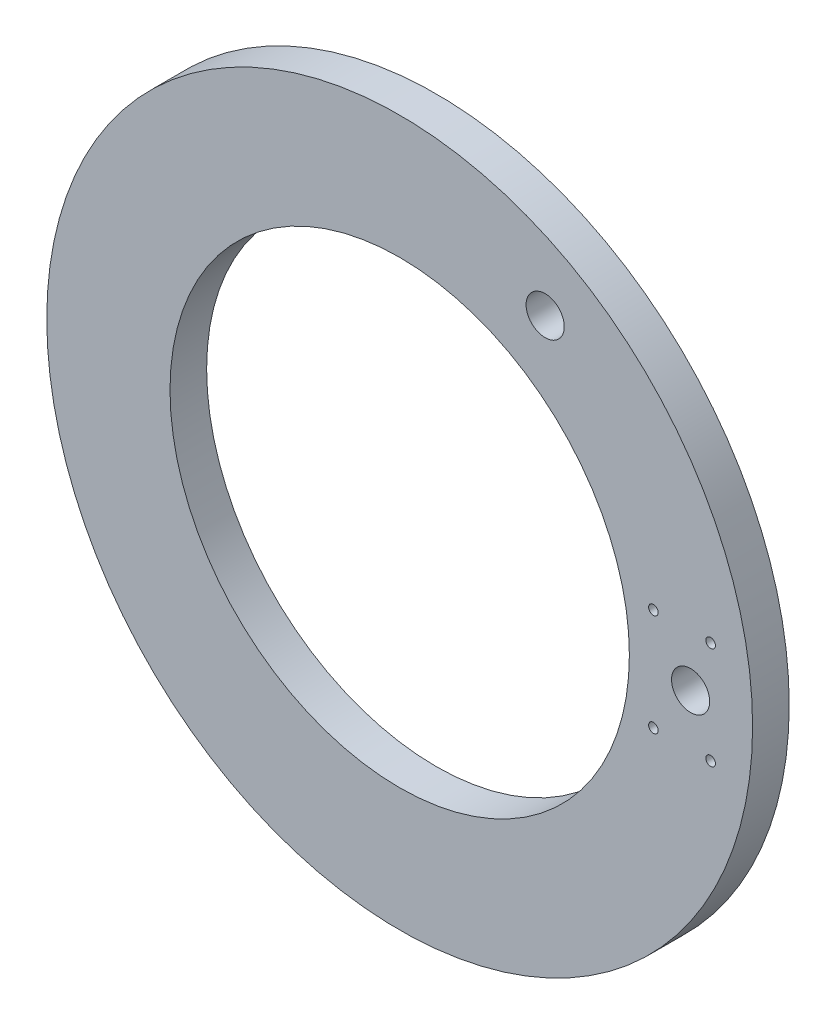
ISO-10303-21;
HEADER;
FILE_DESCRIPTION(('STEP AP214'),'2;1');
FILE_NAME('part.step','',(''),(''),'','','');
FILE_SCHEMA(('AUTOMOTIVE_DESIGN { 1 0 10303 214 1 1 1 1 }'));
ENDSEC;
DATA;
#1=APPLICATION_CONTEXT('core data for automotive mechanical design processes');
#2=APPLICATION_PROTOCOL_DEFINITION('international standard','automotive_design',2000,#1);
#3=PRODUCT_CONTEXT('',#1,'mechanical');
#4=PRODUCT('Part','Part','',(#3));
#5=PRODUCT_RELATED_PRODUCT_CATEGORY('part','',(#4));
#6=PRODUCT_DEFINITION_FORMATION('','',#4);
#7=PRODUCT_DEFINITION_CONTEXT('part definition',#1,'design');
#8=PRODUCT_DEFINITION('design','',#6,#7);
#9=PRODUCT_DEFINITION_SHAPE('','',#8);
#10=(LENGTH_UNIT() NAMED_UNIT(*) SI_UNIT(.MILLI.,.METRE.));
#11=(NAMED_UNIT(*) PLANE_ANGLE_UNIT() SI_UNIT($,.RADIAN.));
#12=(NAMED_UNIT(*) SI_UNIT($,.STERADIAN.) SOLID_ANGLE_UNIT());
#13=UNCERTAINTY_MEASURE_WITH_UNIT(LENGTH_MEASURE(1.E-05),#10,'distance_accuracy_value','');
#14=(GEOMETRIC_REPRESENTATION_CONTEXT(3) GLOBAL_UNCERTAINTY_ASSIGNED_CONTEXT((#13)) GLOBAL_UNIT_ASSIGNED_CONTEXT((#10,
#11,#12)) REPRESENTATION_CONTEXT('',''));
#15=CARTESIAN_POINT('',(0.,0.,0.));
#16=DIRECTION('',(0.,0.,1.));
#17=DIRECTION('',(1.,0.,0.));
#18=AXIS2_PLACEMENT_3D('',#15,#16,#17);
#19=CARTESIAN_POINT('',(0.,0.,24.384));
#20=DIRECTION('',(0.,0.,1.));
#21=DIRECTION('',(1.,0.,0.));
#22=AXIS2_PLACEMENT_3D('',#19,#20,#21);
#23=PLANE('',#22);
#24=CARTESIAN_POINT('',(96.8502,167.7162,24.384));
#25=DIRECTION('',(0.,0.,1.));
#26=DIRECTION('',(1.,0.,0.));
#27=AXIS2_PLACEMENT_3D('',#24,#25,#26);
#28=CIRCLE('',#27,12.7);
#29=CARTESIAN_POINT('',(109.5502,167.7162,24.384));
#30=VERTEX_POINT('',#29);
#31=EDGE_CURVE('E86',#30,#30,#28,.T.);
#32=ORIENTED_EDGE('',*,*,#31,.F.);
#33=EDGE_LOOP('',(#32));
#34=FACE_BOUND('',#33,.T.);
#35=CARTESIAN_POINT('',(207.01,-33.89122,24.384));
#36=DIRECTION('',(0.,0.,1.));
#37=DIRECTION('',(1.,0.,0.));
#38=AXIS2_PLACEMENT_3D('',#35,#36,#37);
#39=CIRCLE('',#38,3.175);
#40=CARTESIAN_POINT('',(210.185,-33.89122,24.384));
#41=VERTEX_POINT('',#40);
#42=EDGE_CURVE('E80',#41,#41,#39,.T.);
#43=ORIENTED_EDGE('',*,*,#42,.F.);
#44=EDGE_LOOP('',(#43));
#45=FACE_BOUND('',#44,.T.);
#46=CARTESIAN_POINT('',(207.01,34.1249,24.384));
#47=DIRECTION('',(0.,0.,1.));
#48=DIRECTION('',(1.,0.,0.));
#49=AXIS2_PLACEMENT_3D('',#46,#47,#48);
#50=CIRCLE('',#49,3.175);
#51=CARTESIAN_POINT('',(210.185,34.1249,24.384));
#52=VERTEX_POINT('',#51);
#53=EDGE_CURVE('E74',#52,#52,#50,.T.);
#54=ORIENTED_EDGE('',*,*,#53,.F.);
#55=EDGE_LOOP('',(#54));
#56=FACE_BOUND('',#55,.T.);
#57=CARTESIAN_POINT('',(168.91,-33.89122,24.384));
#58=DIRECTION('',(0.,0.,1.));
#59=DIRECTION('',(1.,0.,0.));
#60=AXIS2_PLACEMENT_3D('',#57,#58,#59);
#61=CIRCLE('',#60,3.175);
#62=CARTESIAN_POINT('',(172.085,-33.89122,24.384));
#63=VERTEX_POINT('',#62);
#64=EDGE_CURVE('E68',#63,#63,#61,.T.);
#65=ORIENTED_EDGE('',*,*,#64,.F.);
#66=EDGE_LOOP('',(#65));
#67=FACE_BOUND('',#66,.T.);
#68=CARTESIAN_POINT('',(168.91,34.1249,24.384));
#69=DIRECTION('',(0.,0.,1.));
#70=DIRECTION('',(1.,0.,0.));
#71=AXIS2_PLACEMENT_3D('',#68,#69,#70);
#72=CIRCLE('',#71,3.175);
#73=CARTESIAN_POINT('',(172.085,34.1249,24.384));
#74=VERTEX_POINT('',#73);
#75=EDGE_CURVE('E62',#74,#74,#72,.T.);
#76=ORIENTED_EDGE('',*,*,#75,.F.);
#77=EDGE_LOOP('',(#76));
#78=FACE_BOUND('',#77,.T.);
#79=CARTESIAN_POINT('',(193.675,0.,24.384));
#80=DIRECTION('',(0.,0.,1.));
#81=DIRECTION('',(1.,0.,0.));
#82=AXIS2_PLACEMENT_3D('',#79,#80,#81);
#83=CIRCLE('',#82,12.7);
#84=CARTESIAN_POINT('',(206.375,0.,24.384));
#85=VERTEX_POINT('',#84);
#86=EDGE_CURVE('E56',#85,#85,#83,.T.);
#87=ORIENTED_EDGE('',*,*,#86,.F.);
#88=EDGE_LOOP('',(#87));
#89=FACE_BOUND('',#88,.T.);
#90=CARTESIAN_POINT('',(0.,0.,24.384));
#91=DIRECTION('',(0.,0.,1.));
#92=DIRECTION('',(1.,0.,0.));
#93=AXIS2_PLACEMENT_3D('',#90,#91,#92);
#94=CIRCLE('',#93,234.95);
#95=CARTESIAN_POINT('',(-234.95,0.,24.384));
#96=VERTEX_POINT('',#95);
#97=EDGE_CURVE('E10',#96,#96,#94,.T.);
#98=ORIENTED_EDGE('',*,*,#97,.T.);
#99=EDGE_LOOP('',(#98));
#100=FACE_BOUND('',#99,.T.);
#101=CARTESIAN_POINT('',(0.,0.,24.384));
#102=DIRECTION('',(0.,0.,1.));
#103=DIRECTION('',(1.,0.,0.));
#104=AXIS2_PLACEMENT_3D('',#101,#102,#103);
#105=CIRCLE('',#104,152.908);
#106=CARTESIAN_POINT('',(-152.908,0.,24.384));
#107=VERTEX_POINT('',#106);
#108=EDGE_CURVE('E44',#107,#107,#105,.T.);
#109=ORIENTED_EDGE('',*,*,#108,.F.);
#110=EDGE_LOOP('',(#109));
#111=FACE_BOUND('',#110,.T.);
#112=ADVANCED_FACE('F33',(#34,#45,#56,#67,#78,#89,#100,#111),#23,.T.);
#113=CARTESIAN_POINT('',(0.,0.,0.));
#114=DIRECTION('',(0.,0.,1.));
#115=DIRECTION('',(1.,0.,0.));
#116=AXIS2_PLACEMENT_3D('',#113,#114,#115);
#117=PLANE('',#116);
#118=CARTESIAN_POINT('',(96.8502,167.7162,0.));
#119=DIRECTION('',(0.,0.,1.));
#120=DIRECTION('',(1.,0.,0.));
#121=AXIS2_PLACEMENT_3D('',#118,#119,#120);
#122=CIRCLE('',#121,12.7);
#123=CARTESIAN_POINT('',(109.5502,167.7162,0.));
#124=VERTEX_POINT('',#123);
#125=EDGE_CURVE('E83',#124,#124,#122,.T.);
#126=ORIENTED_EDGE('',*,*,#125,.T.);
#127=EDGE_LOOP('',(#126));
#128=FACE_BOUND('',#127,.T.);
#129=CARTESIAN_POINT('',(207.01,-33.89122,0.));
#130=DIRECTION('',(0.,0.,1.));
#131=DIRECTION('',(1.,0.,0.));
#132=AXIS2_PLACEMENT_3D('',#129,#130,#131);
#133=CIRCLE('',#132,3.175);
#134=CARTESIAN_POINT('',(210.185,-33.89122,0.));
#135=VERTEX_POINT('',#134);
#136=EDGE_CURVE('E77',#135,#135,#133,.T.);
#137=ORIENTED_EDGE('',*,*,#136,.T.);
#138=EDGE_LOOP('',(#137));
#139=FACE_BOUND('',#138,.T.);
#140=CARTESIAN_POINT('',(207.01,34.1249,0.));
#141=DIRECTION('',(0.,0.,1.));
#142=DIRECTION('',(1.,0.,0.));
#143=AXIS2_PLACEMENT_3D('',#140,#141,#142);
#144=CIRCLE('',#143,3.175);
#145=CARTESIAN_POINT('',(210.185,34.1249,0.));
#146=VERTEX_POINT('',#145);
#147=EDGE_CURVE('E71',#146,#146,#144,.T.);
#148=ORIENTED_EDGE('',*,*,#147,.T.);
#149=EDGE_LOOP('',(#148));
#150=FACE_BOUND('',#149,.T.);
#151=CARTESIAN_POINT('',(168.91,-33.89122,0.));
#152=DIRECTION('',(0.,0.,1.));
#153=DIRECTION('',(1.,0.,0.));
#154=AXIS2_PLACEMENT_3D('',#151,#152,#153);
#155=CIRCLE('',#154,3.175);
#156=CARTESIAN_POINT('',(172.085,-33.89122,0.));
#157=VERTEX_POINT('',#156);
#158=EDGE_CURVE('E65',#157,#157,#155,.T.);
#159=ORIENTED_EDGE('',*,*,#158,.T.);
#160=EDGE_LOOP('',(#159));
#161=FACE_BOUND('',#160,.T.);
#162=CARTESIAN_POINT('',(168.91,34.1249,0.));
#163=DIRECTION('',(0.,0.,1.));
#164=DIRECTION('',(1.,0.,0.));
#165=AXIS2_PLACEMENT_3D('',#162,#163,#164);
#166=CIRCLE('',#165,3.175);
#167=CARTESIAN_POINT('',(172.085,34.1249,0.));
#168=VERTEX_POINT('',#167);
#169=EDGE_CURVE('E59',#168,#168,#166,.T.);
#170=ORIENTED_EDGE('',*,*,#169,.T.);
#171=EDGE_LOOP('',(#170));
#172=FACE_BOUND('',#171,.T.);
#173=CARTESIAN_POINT('',(193.675,0.,0.));
#174=DIRECTION('',(0.,0.,1.));
#175=DIRECTION('',(1.,0.,0.));
#176=AXIS2_PLACEMENT_3D('',#173,#174,#175);
#177=CIRCLE('',#176,12.7);
#178=CARTESIAN_POINT('',(206.375,0.,0.));
#179=VERTEX_POINT('',#178);
#180=EDGE_CURVE('E53',#179,#179,#177,.T.);
#181=ORIENTED_EDGE('',*,*,#180,.T.);
#182=EDGE_LOOP('',(#181));
#183=FACE_BOUND('',#182,.T.);
#184=CARTESIAN_POINT('',(0.,0.,0.));
#185=DIRECTION('',(0.,0.,1.));
#186=DIRECTION('',(1.,0.,0.));
#187=AXIS2_PLACEMENT_3D('',#184,#185,#186);
#188=CIRCLE('',#187,234.95);
#189=CARTESIAN_POINT('',(-234.95,0.,0.));
#190=VERTEX_POINT('',#189);
#191=EDGE_CURVE('E40',#190,#190,#188,.T.);
#192=ORIENTED_EDGE('',*,*,#191,.F.);
#193=EDGE_LOOP('',(#192));
#194=FACE_BOUND('',#193,.T.);
#195=CARTESIAN_POINT('',(0.,0.,0.));
#196=DIRECTION('',(0.,0.,1.));
#197=DIRECTION('',(1.,0.,0.));
#198=AXIS2_PLACEMENT_3D('',#195,#196,#197);
#199=CIRCLE('',#198,152.908);
#200=CARTESIAN_POINT('',(-152.908,0.,0.));
#201=VERTEX_POINT('',#200);
#202=EDGE_CURVE('E48',#201,#201,#199,.T.);
#203=ORIENTED_EDGE('',*,*,#202,.T.);
#204=EDGE_LOOP('',(#203));
#205=FACE_BOUND('',#204,.T.);
#206=ADVANCED_FACE('F94',(#128,#139,#150,#161,#172,#183,#194,#205),#117,.F.);
#207=CARTESIAN_POINT('',(0.,0.,24.384));
#208=DIRECTION('',(0.,0.,-1.));
#209=DIRECTION('',(-1.,0.,0.));
#210=AXIS2_PLACEMENT_3D('',#207,#208,#209);
#211=CYLINDRICAL_SURFACE('',#210,234.95);
#212=CARTESIAN_POINT('',(-234.95,0.,24.384));
#213=CARTESIAN_POINT('',(-234.95,0.,24.13));
#214=CARTESIAN_POINT('',(-234.95,0.,23.876));
#215=CARTESIAN_POINT('',(-234.95,0.,23.368));
#216=CARTESIAN_POINT('',(-234.95,0.,23.114));
#217=CARTESIAN_POINT('',(-234.95,0.,22.606));
#218=CARTESIAN_POINT('',(-234.95,0.,22.352));
#219=CARTESIAN_POINT('',(-234.95,0.,21.844));
#220=CARTESIAN_POINT('',(-234.95,0.,21.59));
#221=CARTESIAN_POINT('',(-234.95,0.,21.082));
#222=CARTESIAN_POINT('',(-234.95,0.,20.828));
#223=CARTESIAN_POINT('',(-234.95,0.,20.32));
#224=CARTESIAN_POINT('',(-234.95,0.,20.066));
#225=CARTESIAN_POINT('',(-234.95,0.,19.558));
#226=CARTESIAN_POINT('',(-234.95,0.,19.304));
#227=CARTESIAN_POINT('',(-234.95,0.,18.796));
#228=CARTESIAN_POINT('',(-234.95,0.,18.542));
#229=CARTESIAN_POINT('',(-234.95,0.,18.034));
#230=CARTESIAN_POINT('',(-234.95,0.,17.78));
#231=CARTESIAN_POINT('',(-234.95,0.,17.272));
#232=CARTESIAN_POINT('',(-234.95,0.,17.018));
#233=CARTESIAN_POINT('',(-234.95,0.,16.51));
#234=CARTESIAN_POINT('',(-234.95,0.,16.256));
#235=CARTESIAN_POINT('',(-234.95,0.,15.748));
#236=CARTESIAN_POINT('',(-234.95,0.,15.494));
#237=CARTESIAN_POINT('',(-234.95,0.,14.986));
#238=CARTESIAN_POINT('',(-234.95,0.,14.732));
#239=CARTESIAN_POINT('',(-234.95,0.,14.224));
#240=CARTESIAN_POINT('',(-234.95,0.,13.97));
#241=CARTESIAN_POINT('',(-234.95,0.,13.462));
#242=CARTESIAN_POINT('',(-234.95,0.,13.208));
#243=CARTESIAN_POINT('',(-234.95,0.,12.7));
#244=CARTESIAN_POINT('',(-234.95,0.,12.446));
#245=CARTESIAN_POINT('',(-234.95,0.,11.938));
#246=CARTESIAN_POINT('',(-234.95,0.,11.684));
#247=CARTESIAN_POINT('',(-234.95,0.,11.176));
#248=CARTESIAN_POINT('',(-234.95,0.,10.922));
#249=CARTESIAN_POINT('',(-234.95,0.,10.414));
#250=CARTESIAN_POINT('',(-234.95,0.,10.16));
#251=CARTESIAN_POINT('',(-234.95,0.,9.652));
#252=CARTESIAN_POINT('',(-234.95,0.,9.398));
#253=CARTESIAN_POINT('',(-234.95,0.,8.89));
#254=CARTESIAN_POINT('',(-234.95,0.,8.636));
#255=CARTESIAN_POINT('',(-234.95,0.,8.128));
#256=CARTESIAN_POINT('',(-234.95,0.,7.874));
#257=CARTESIAN_POINT('',(-234.95,0.,7.366));
#258=CARTESIAN_POINT('',(-234.95,0.,7.112));
#259=CARTESIAN_POINT('',(-234.95,0.,6.604));
#260=CARTESIAN_POINT('',(-234.95,0.,6.35));
#261=CARTESIAN_POINT('',(-234.95,0.,5.842));
#262=CARTESIAN_POINT('',(-234.95,0.,5.588));
#263=CARTESIAN_POINT('',(-234.95,0.,5.08));
#264=CARTESIAN_POINT('',(-234.95,0.,4.826));
#265=CARTESIAN_POINT('',(-234.95,0.,4.318));
#266=CARTESIAN_POINT('',(-234.95,0.,4.064));
#267=CARTESIAN_POINT('',(-234.95,0.,3.556));
#268=CARTESIAN_POINT('',(-234.95,0.,3.302));
#269=CARTESIAN_POINT('',(-234.95,0.,2.794));
#270=CARTESIAN_POINT('',(-234.95,0.,2.54));
#271=CARTESIAN_POINT('',(-234.95,0.,2.032));
#272=CARTESIAN_POINT('',(-234.95,0.,1.778));
#273=CARTESIAN_POINT('',(-234.95,0.,1.27));
#274=CARTESIAN_POINT('',(-234.95,0.,1.016));
#275=CARTESIAN_POINT('',(-234.95,0.,0.507999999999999));
#276=CARTESIAN_POINT('',(-234.95,0.,0.254));
#277=CARTESIAN_POINT('',(-234.95,0.,0.));
#278=B_SPLINE_CURVE_WITH_KNOTS('',3,(#212,#213,#214,#215,#216,#217,#218,#219,#220,#221,#222,
#223,#224,#225,#226,#227,#228,#229,#230,#231,#232,#233,#234,#235,#236,#237,#238,#239,#240,#241,
#242,#243,#244,#245,#246,#247,#248,#249,#250,#251,#252,#253,#254,#255,#256,#257,#258,#259,#260,
#261,#262,#263,#264,#265,#266,#267,#268,#269,#270,#271,#272,#273,#274,#275,#276,#277),
.UNSPECIFIED.,.F.,.F.,(4,2,2,2,2,2,2,2,2,2,2,2,2,2,2,2,2,2,2,2,2,2,2,2,2,2,2,2,2,2,2,2,4),(0.,
0.761999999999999,1.524,2.286,3.048,3.81,4.572,5.334,6.096,6.858,7.62,8.382,9.144,9.906,10.668,
11.43,12.192,12.954,13.716,14.478,15.24,16.002,16.764,17.526,18.288,19.05,19.812,20.574,21.336,
22.098,22.86,23.622,24.384),.UNSPECIFIED.);
#279=EDGE_CURVE('BSEAM35',#96,#190,#278,.T.);
#280=ORIENTED_EDGE('',*,*,#97,.F.);
#281=ORIENTED_EDGE('',*,*,#191,.T.);
#282=ORIENTED_EDGE('',*,*,#279,.T.);
#283=ORIENTED_EDGE('',*,*,#279,.F.);
#284=EDGE_LOOP('',(#280,#282,#281,#283));
#285=FACE_BOUND('',#284,.T.);
#286=ADVANCED_FACE('F35',(#285),#211,.T.);
#287=CARTESIAN_POINT('',(0.,0.,24.384));
#288=DIRECTION('',(0.,0.,-1.));
#289=DIRECTION('',(-1.,0.,0.));
#290=AXIS2_PLACEMENT_3D('',#287,#288,#289);
#291=CYLINDRICAL_SURFACE('',#290,152.908);
#292=CARTESIAN_POINT('',(-152.908,0.,24.384));
#293=CARTESIAN_POINT('',(-152.908,0.,24.13));
#294=CARTESIAN_POINT('',(-152.908,0.,23.876));
#295=CARTESIAN_POINT('',(-152.908,0.,23.368));
#296=CARTESIAN_POINT('',(-152.908,0.,23.114));
#297=CARTESIAN_POINT('',(-152.908,0.,22.606));
#298=CARTESIAN_POINT('',(-152.908,0.,22.352));
#299=CARTESIAN_POINT('',(-152.908,0.,21.844));
#300=CARTESIAN_POINT('',(-152.908,0.,21.59));
#301=CARTESIAN_POINT('',(-152.908,0.,21.082));
#302=CARTESIAN_POINT('',(-152.908,0.,20.828));
#303=CARTESIAN_POINT('',(-152.908,0.,20.32));
#304=CARTESIAN_POINT('',(-152.908,0.,20.066));
#305=CARTESIAN_POINT('',(-152.908,0.,19.558));
#306=CARTESIAN_POINT('',(-152.908,0.,19.304));
#307=CARTESIAN_POINT('',(-152.908,0.,18.796));
#308=CARTESIAN_POINT('',(-152.908,0.,18.542));
#309=CARTESIAN_POINT('',(-152.908,0.,18.034));
#310=CARTESIAN_POINT('',(-152.908,0.,17.78));
#311=CARTESIAN_POINT('',(-152.908,0.,17.272));
#312=CARTESIAN_POINT('',(-152.908,0.,17.018));
#313=CARTESIAN_POINT('',(-152.908,0.,16.51));
#314=CARTESIAN_POINT('',(-152.908,0.,16.256));
#315=CARTESIAN_POINT('',(-152.908,0.,15.748));
#316=CARTESIAN_POINT('',(-152.908,0.,15.494));
#317=CARTESIAN_POINT('',(-152.908,0.,14.986));
#318=CARTESIAN_POINT('',(-152.908,0.,14.732));
#319=CARTESIAN_POINT('',(-152.908,0.,14.224));
#320=CARTESIAN_POINT('',(-152.908,0.,13.97));
#321=CARTESIAN_POINT('',(-152.908,0.,13.462));
#322=CARTESIAN_POINT('',(-152.908,0.,13.208));
#323=CARTESIAN_POINT('',(-152.908,0.,12.7));
#324=CARTESIAN_POINT('',(-152.908,0.,12.446));
#325=CARTESIAN_POINT('',(-152.908,0.,11.938));
#326=CARTESIAN_POINT('',(-152.908,0.,11.684));
#327=CARTESIAN_POINT('',(-152.908,0.,11.176));
#328=CARTESIAN_POINT('',(-152.908,0.,10.922));
#329=CARTESIAN_POINT('',(-152.908,0.,10.414));
#330=CARTESIAN_POINT('',(-152.908,0.,10.16));
#331=CARTESIAN_POINT('',(-152.908,0.,9.652));
#332=CARTESIAN_POINT('',(-152.908,0.,9.398));
#333=CARTESIAN_POINT('',(-152.908,0.,8.89));
#334=CARTESIAN_POINT('',(-152.908,0.,8.636));
#335=CARTESIAN_POINT('',(-152.908,0.,8.128));
#336=CARTESIAN_POINT('',(-152.908,0.,7.874));
#337=CARTESIAN_POINT('',(-152.908,0.,7.366));
#338=CARTESIAN_POINT('',(-152.908,0.,7.112));
#339=CARTESIAN_POINT('',(-152.908,0.,6.604));
#340=CARTESIAN_POINT('',(-152.908,0.,6.35));
#341=CARTESIAN_POINT('',(-152.908,0.,5.842));
#342=CARTESIAN_POINT('',(-152.908,0.,5.588));
#343=CARTESIAN_POINT('',(-152.908,0.,5.08));
#344=CARTESIAN_POINT('',(-152.908,0.,4.826));
#345=CARTESIAN_POINT('',(-152.908,0.,4.318));
#346=CARTESIAN_POINT('',(-152.908,0.,4.064));
#347=CARTESIAN_POINT('',(-152.908,0.,3.556));
#348=CARTESIAN_POINT('',(-152.908,0.,3.302));
#349=CARTESIAN_POINT('',(-152.908,0.,2.794));
#350=CARTESIAN_POINT('',(-152.908,0.,2.54));
#351=CARTESIAN_POINT('',(-152.908,0.,2.032));
#352=CARTESIAN_POINT('',(-152.908,0.,1.778));
#353=CARTESIAN_POINT('',(-152.908,0.,1.27));
#354=CARTESIAN_POINT('',(-152.908,0.,1.016));
#355=CARTESIAN_POINT('',(-152.908,0.,0.507999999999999));
#356=CARTESIAN_POINT('',(-152.908,0.,0.254));
#357=CARTESIAN_POINT('',(-152.908,0.,0.));
#358=B_SPLINE_CURVE_WITH_KNOTS('',3,(#292,#293,#294,#295,#296,#297,#298,#299,#300,#301,#302,
#303,#304,#305,#306,#307,#308,#309,#310,#311,#312,#313,#314,#315,#316,#317,#318,#319,#320,#321,
#322,#323,#324,#325,#326,#327,#328,#329,#330,#331,#332,#333,#334,#335,#336,#337,#338,#339,#340,
#341,#342,#343,#344,#345,#346,#347,#348,#349,#350,#351,#352,#353,#354,#355,#356,#357),
.UNSPECIFIED.,.F.,.F.,(4,2,2,2,2,2,2,2,2,2,2,2,2,2,2,2,2,2,2,2,2,2,2,2,2,2,2,2,2,2,2,2,4),(0.,
0.762000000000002,1.524,2.286,3.048,3.81,4.572,5.334,6.096,6.858,7.62,8.382,9.144,9.906,10.668,
11.43,12.192,12.954,13.716,14.478,15.24,16.002,16.764,17.526,18.288,19.05,19.812,20.574,21.336,
22.098,22.86,23.622,24.384),.UNSPECIFIED.);
#359=EDGE_CURVE('BSEAM107',#107,#201,#358,.T.);
#360=ORIENTED_EDGE('',*,*,#108,.T.);
#361=ORIENTED_EDGE('',*,*,#202,.F.);
#362=ORIENTED_EDGE('',*,*,#359,.T.);
#363=ORIENTED_EDGE('',*,*,#359,.F.);
#364=EDGE_LOOP('',(#360,#362,#361,#363));
#365=FACE_BOUND('',#364,.T.);
#366=ADVANCED_FACE('F107',(#365),#291,.F.);
#367=CARTESIAN_POINT('',(193.675,0.,0.));
#368=DIRECTION('',(0.,0.,1.));
#369=DIRECTION('',(1.,0.,0.));
#370=AXIS2_PLACEMENT_3D('',#367,#368,#369);
#371=CYLINDRICAL_SURFACE('',#370,12.7);
#372=CARTESIAN_POINT('',(206.375,0.,0.));
#373=CARTESIAN_POINT('',(206.375,0.,0.254));
#374=CARTESIAN_POINT('',(206.375,0.,0.508));
#375=CARTESIAN_POINT('',(206.375,0.,1.016));
#376=CARTESIAN_POINT('',(206.375,0.,1.27));
#377=CARTESIAN_POINT('',(206.375,0.,1.778));
#378=CARTESIAN_POINT('',(206.375,0.,2.032));
#379=CARTESIAN_POINT('',(206.375,0.,2.54));
#380=CARTESIAN_POINT('',(206.375,0.,2.794));
#381=CARTESIAN_POINT('',(206.375,0.,3.302));
#382=CARTESIAN_POINT('',(206.375,0.,3.556));
#383=CARTESIAN_POINT('',(206.375,0.,4.064));
#384=CARTESIAN_POINT('',(206.375,0.,4.318));
#385=CARTESIAN_POINT('',(206.375,0.,4.826));
#386=CARTESIAN_POINT('',(206.375,0.,5.08));
#387=CARTESIAN_POINT('',(206.375,0.,5.588));
#388=CARTESIAN_POINT('',(206.375,0.,5.842));
#389=CARTESIAN_POINT('',(206.375,0.,6.35));
#390=CARTESIAN_POINT('',(206.375,0.,6.604));
#391=CARTESIAN_POINT('',(206.375,0.,7.112));
#392=CARTESIAN_POINT('',(206.375,0.,7.366));
#393=CARTESIAN_POINT('',(206.375,0.,7.874));
#394=CARTESIAN_POINT('',(206.375,0.,8.128));
#395=CARTESIAN_POINT('',(206.375,0.,8.636));
#396=CARTESIAN_POINT('',(206.375,0.,8.89));
#397=CARTESIAN_POINT('',(206.375,0.,9.398));
#398=CARTESIAN_POINT('',(206.375,0.,9.652));
#399=CARTESIAN_POINT('',(206.375,0.,10.16));
#400=CARTESIAN_POINT('',(206.375,0.,10.414));
#401=CARTESIAN_POINT('',(206.375,0.,10.922));
#402=CARTESIAN_POINT('',(206.375,0.,11.176));
#403=CARTESIAN_POINT('',(206.375,0.,11.684));
#404=CARTESIAN_POINT('',(206.375,0.,11.938));
#405=CARTESIAN_POINT('',(206.375,0.,12.446));
#406=CARTESIAN_POINT('',(206.375,0.,12.7));
#407=CARTESIAN_POINT('',(206.375,0.,13.208));
#408=CARTESIAN_POINT('',(206.375,0.,13.462));
#409=CARTESIAN_POINT('',(206.375,0.,13.97));
#410=CARTESIAN_POINT('',(206.375,0.,14.224));
#411=CARTESIAN_POINT('',(206.375,0.,14.732));
#412=CARTESIAN_POINT('',(206.375,0.,14.986));
#413=CARTESIAN_POINT('',(206.375,0.,15.494));
#414=CARTESIAN_POINT('',(206.375,0.,15.748));
#415=CARTESIAN_POINT('',(206.375,0.,16.256));
#416=CARTESIAN_POINT('',(206.375,0.,16.51));
#417=CARTESIAN_POINT('',(206.375,0.,17.018));
#418=CARTESIAN_POINT('',(206.375,0.,17.272));
#419=CARTESIAN_POINT('',(206.375,0.,17.78));
#420=CARTESIAN_POINT('',(206.375,0.,18.034));
#421=CARTESIAN_POINT('',(206.375,0.,18.542));
#422=CARTESIAN_POINT('',(206.375,0.,18.796));
#423=CARTESIAN_POINT('',(206.375,0.,19.304));
#424=CARTESIAN_POINT('',(206.375,0.,19.558));
#425=CARTESIAN_POINT('',(206.375,0.,20.066));
#426=CARTESIAN_POINT('',(206.375,0.,20.32));
#427=CARTESIAN_POINT('',(206.375,0.,20.828));
#428=CARTESIAN_POINT('',(206.375,0.,21.082));
#429=CARTESIAN_POINT('',(206.375,0.,21.59));
#430=CARTESIAN_POINT('',(206.375,0.,21.844));
#431=CARTESIAN_POINT('',(206.375,0.,22.352));
#432=CARTESIAN_POINT('',(206.375,0.,22.606));
#433=CARTESIAN_POINT('',(206.375,0.,23.114));
#434=CARTESIAN_POINT('',(206.375,0.,23.368));
#435=CARTESIAN_POINT('',(206.375,0.,23.876));
#436=CARTESIAN_POINT('',(206.375,0.,24.13));
#437=CARTESIAN_POINT('',(206.375,0.,24.384));
#438=B_SPLINE_CURVE_WITH_KNOTS('',3,(#372,#373,#374,#375,#376,#377,#378,#379,#380,#381,#382,
#383,#384,#385,#386,#387,#388,#389,#390,#391,#392,#393,#394,#395,#396,#397,#398,#399,#400,#401,
#402,#403,#404,#405,#406,#407,#408,#409,#410,#411,#412,#413,#414,#415,#416,#417,#418,#419,#420,
#421,#422,#423,#424,#425,#426,#427,#428,#429,#430,#431,#432,#433,#434,#435,#436,#437),
.UNSPECIFIED.,.F.,.F.,(4,2,2,2,2,2,2,2,2,2,2,2,2,2,2,2,2,2,2,2,2,2,2,2,2,2,2,2,2,2,2,2,4),(0.,
0.762,1.524,2.286,3.048,3.81,4.572,5.334,6.096,6.858,7.62,8.382,9.144,9.906,10.668,11.43,12.192,
12.954,13.716,14.478,15.24,16.002,16.764,17.526,18.288,19.05,19.812,20.574,21.336,22.098,22.86,
23.622,24.384),.UNSPECIFIED.);
#439=EDGE_CURVE('BSEAM110',#179,#85,#438,.T.);
#440=ORIENTED_EDGE('',*,*,#180,.F.);
#441=ORIENTED_EDGE('',*,*,#86,.T.);
#442=ORIENTED_EDGE('',*,*,#439,.T.);
#443=ORIENTED_EDGE('',*,*,#439,.F.);
#444=EDGE_LOOP('',(#440,#442,#441,#443));
#445=FACE_BOUND('',#444,.T.);
#446=ADVANCED_FACE('F110',(#445),#371,.F.);
#447=CARTESIAN_POINT('',(168.91,34.1249,0.));
#448=DIRECTION('',(0.,0.,1.));
#449=DIRECTION('',(1.,0.,0.));
#450=AXIS2_PLACEMENT_3D('',#447,#448,#449);
#451=CYLINDRICAL_SURFACE('',#450,3.175);
#452=CARTESIAN_POINT('',(172.085,34.1249,0.));
#453=CARTESIAN_POINT('',(172.085,34.1249,0.254));
#454=CARTESIAN_POINT('',(172.085,34.1249,0.508));
#455=CARTESIAN_POINT('',(172.085,34.1249,1.016));
#456=CARTESIAN_POINT('',(172.085,34.1249,1.27));
#457=CARTESIAN_POINT('',(172.085,34.1249,1.778));
#458=CARTESIAN_POINT('',(172.085,34.1249,2.032));
#459=CARTESIAN_POINT('',(172.085,34.1249,2.54));
#460=CARTESIAN_POINT('',(172.085,34.1249,2.794));
#461=CARTESIAN_POINT('',(172.085,34.1249,3.302));
#462=CARTESIAN_POINT('',(172.085,34.1249,3.556));
#463=CARTESIAN_POINT('',(172.085,34.1249,4.064));
#464=CARTESIAN_POINT('',(172.085,34.1249,4.318));
#465=CARTESIAN_POINT('',(172.085,34.1249,4.826));
#466=CARTESIAN_POINT('',(172.085,34.1249,5.08));
#467=CARTESIAN_POINT('',(172.085,34.1249,5.588));
#468=CARTESIAN_POINT('',(172.085,34.1249,5.842));
#469=CARTESIAN_POINT('',(172.085,34.1249,6.35));
#470=CARTESIAN_POINT('',(172.085,34.1249,6.604));
#471=CARTESIAN_POINT('',(172.085,34.1249,7.112));
#472=CARTESIAN_POINT('',(172.085,34.1249,7.366));
#473=CARTESIAN_POINT('',(172.085,34.1249,7.874));
#474=CARTESIAN_POINT('',(172.085,34.1249,8.128));
#475=CARTESIAN_POINT('',(172.085,34.1249,8.636));
#476=CARTESIAN_POINT('',(172.085,34.1249,8.89));
#477=CARTESIAN_POINT('',(172.085,34.1249,9.398));
#478=CARTESIAN_POINT('',(172.085,34.1249,9.652));
#479=CARTESIAN_POINT('',(172.085,34.1249,10.16));
#480=CARTESIAN_POINT('',(172.085,34.1249,10.414));
#481=CARTESIAN_POINT('',(172.085,34.1249,10.922));
#482=CARTESIAN_POINT('',(172.085,34.1249,11.176));
#483=CARTESIAN_POINT('',(172.085,34.1249,11.684));
#484=CARTESIAN_POINT('',(172.085,34.1249,11.938));
#485=CARTESIAN_POINT('',(172.085,34.1249,12.446));
#486=CARTESIAN_POINT('',(172.085,34.1249,12.7));
#487=CARTESIAN_POINT('',(172.085,34.1249,13.208));
#488=CARTESIAN_POINT('',(172.085,34.1249,13.462));
#489=CARTESIAN_POINT('',(172.085,34.1249,13.97));
#490=CARTESIAN_POINT('',(172.085,34.1249,14.224));
#491=CARTESIAN_POINT('',(172.085,34.1249,14.732));
#492=CARTESIAN_POINT('',(172.085,34.1249,14.986));
#493=CARTESIAN_POINT('',(172.085,34.1249,15.494));
#494=CARTESIAN_POINT('',(172.085,34.1249,15.748));
#495=CARTESIAN_POINT('',(172.085,34.1249,16.256));
#496=CARTESIAN_POINT('',(172.085,34.1249,16.51));
#497=CARTESIAN_POINT('',(172.085,34.1249,17.018));
#498=CARTESIAN_POINT('',(172.085,34.1249,17.272));
#499=CARTESIAN_POINT('',(172.085,34.1249,17.78));
#500=CARTESIAN_POINT('',(172.085,34.1249,18.034));
#501=CARTESIAN_POINT('',(172.085,34.1249,18.542));
#502=CARTESIAN_POINT('',(172.085,34.1249,18.796));
#503=CARTESIAN_POINT('',(172.085,34.1249,19.304));
#504=CARTESIAN_POINT('',(172.085,34.1249,19.558));
#505=CARTESIAN_POINT('',(172.085,34.1249,20.066));
#506=CARTESIAN_POINT('',(172.085,34.1249,20.32));
#507=CARTESIAN_POINT('',(172.085,34.1249,20.828));
#508=CARTESIAN_POINT('',(172.085,34.1249,21.082));
#509=CARTESIAN_POINT('',(172.085,34.1249,21.59));
#510=CARTESIAN_POINT('',(172.085,34.1249,21.844));
#511=CARTESIAN_POINT('',(172.085,34.1249,22.352));
#512=CARTESIAN_POINT('',(172.085,34.1249,22.606));
#513=CARTESIAN_POINT('',(172.085,34.1249,23.114));
#514=CARTESIAN_POINT('',(172.085,34.1249,23.368));
#515=CARTESIAN_POINT('',(172.085,34.1249,23.876));
#516=CARTESIAN_POINT('',(172.085,34.1249,24.13));
#517=CARTESIAN_POINT('',(172.085,34.1249,24.384));
#518=B_SPLINE_CURVE_WITH_KNOTS('',3,(#452,#453,#454,#455,#456,#457,#458,#459,#460,#461,#462,
#463,#464,#465,#466,#467,#468,#469,#470,#471,#472,#473,#474,#475,#476,#477,#478,#479,#480,#481,
#482,#483,#484,#485,#486,#487,#488,#489,#490,#491,#492,#493,#494,#495,#496,#497,#498,#499,#500,
#501,#502,#503,#504,#505,#506,#507,#508,#509,#510,#511,#512,#513,#514,#515,#516,#517),
.UNSPECIFIED.,.F.,.F.,(4,2,2,2,2,2,2,2,2,2,2,2,2,2,2,2,2,2,2,2,2,2,2,2,2,2,2,2,2,2,2,2,4),(0.,
0.762,1.524,2.286,3.048,3.81,4.572,5.334,6.096,6.858,7.62,8.382,9.144,9.906,10.668,11.43,12.192,
12.954,13.716,14.478,15.24,16.002,16.764,17.526,18.288,19.05,19.812,20.574,21.336,22.098,22.86,
23.622,24.384),.UNSPECIFIED.);
#519=EDGE_CURVE('BSEAM125',#168,#74,#518,.T.);
#520=ORIENTED_EDGE('',*,*,#169,.F.);
#521=ORIENTED_EDGE('',*,*,#75,.T.);
#522=ORIENTED_EDGE('',*,*,#519,.T.);
#523=ORIENTED_EDGE('',*,*,#519,.F.);
#524=EDGE_LOOP('',(#520,#522,#521,#523));
#525=FACE_BOUND('',#524,.T.);
#526=ADVANCED_FACE('F125',(#525),#451,.F.);
#527=CARTESIAN_POINT('',(168.91,-33.89122,0.));
#528=DIRECTION('',(0.,0.,1.));
#529=DIRECTION('',(1.,0.,0.));
#530=AXIS2_PLACEMENT_3D('',#527,#528,#529);
#531=CYLINDRICAL_SURFACE('',#530,3.175);
#532=CARTESIAN_POINT('',(172.085,-33.89122,0.));
#533=CARTESIAN_POINT('',(172.085,-33.89122,0.254));
#534=CARTESIAN_POINT('',(172.085,-33.89122,0.508));
#535=CARTESIAN_POINT('',(172.085,-33.89122,1.016));
#536=CARTESIAN_POINT('',(172.085,-33.89122,1.27));
#537=CARTESIAN_POINT('',(172.085,-33.89122,1.778));
#538=CARTESIAN_POINT('',(172.085,-33.89122,2.032));
#539=CARTESIAN_POINT('',(172.085,-33.89122,2.54));
#540=CARTESIAN_POINT('',(172.085,-33.89122,2.794));
#541=CARTESIAN_POINT('',(172.085,-33.89122,3.302));
#542=CARTESIAN_POINT('',(172.085,-33.89122,3.556));
#543=CARTESIAN_POINT('',(172.085,-33.89122,4.064));
#544=CARTESIAN_POINT('',(172.085,-33.89122,4.318));
#545=CARTESIAN_POINT('',(172.085,-33.89122,4.826));
#546=CARTESIAN_POINT('',(172.085,-33.89122,5.08));
#547=CARTESIAN_POINT('',(172.085,-33.89122,5.588));
#548=CARTESIAN_POINT('',(172.085,-33.89122,5.842));
#549=CARTESIAN_POINT('',(172.085,-33.89122,6.35));
#550=CARTESIAN_POINT('',(172.085,-33.89122,6.604));
#551=CARTESIAN_POINT('',(172.085,-33.89122,7.112));
#552=CARTESIAN_POINT('',(172.085,-33.89122,7.366));
#553=CARTESIAN_POINT('',(172.085,-33.89122,7.874));
#554=CARTESIAN_POINT('',(172.085,-33.89122,8.128));
#555=CARTESIAN_POINT('',(172.085,-33.89122,8.636));
#556=CARTESIAN_POINT('',(172.085,-33.89122,8.89));
#557=CARTESIAN_POINT('',(172.085,-33.89122,9.398));
#558=CARTESIAN_POINT('',(172.085,-33.89122,9.652));
#559=CARTESIAN_POINT('',(172.085,-33.89122,10.16));
#560=CARTESIAN_POINT('',(172.085,-33.89122,10.414));
#561=CARTESIAN_POINT('',(172.085,-33.89122,10.922));
#562=CARTESIAN_POINT('',(172.085,-33.89122,11.176));
#563=CARTESIAN_POINT('',(172.085,-33.89122,11.684));
#564=CARTESIAN_POINT('',(172.085,-33.89122,11.938));
#565=CARTESIAN_POINT('',(172.085,-33.89122,12.446));
#566=CARTESIAN_POINT('',(172.085,-33.89122,12.7));
#567=CARTESIAN_POINT('',(172.085,-33.89122,13.208));
#568=CARTESIAN_POINT('',(172.085,-33.89122,13.462));
#569=CARTESIAN_POINT('',(172.085,-33.89122,13.97));
#570=CARTESIAN_POINT('',(172.085,-33.89122,14.224));
#571=CARTESIAN_POINT('',(172.085,-33.89122,14.732));
#572=CARTESIAN_POINT('',(172.085,-33.89122,14.986));
#573=CARTESIAN_POINT('',(172.085,-33.89122,15.494));
#574=CARTESIAN_POINT('',(172.085,-33.89122,15.748));
#575=CARTESIAN_POINT('',(172.085,-33.89122,16.256));
#576=CARTESIAN_POINT('',(172.085,-33.89122,16.51));
#577=CARTESIAN_POINT('',(172.085,-33.89122,17.018));
#578=CARTESIAN_POINT('',(172.085,-33.89122,17.272));
#579=CARTESIAN_POINT('',(172.085,-33.89122,17.78));
#580=CARTESIAN_POINT('',(172.085,-33.89122,18.034));
#581=CARTESIAN_POINT('',(172.085,-33.89122,18.542));
#582=CARTESIAN_POINT('',(172.085,-33.89122,18.796));
#583=CARTESIAN_POINT('',(172.085,-33.89122,19.304));
#584=CARTESIAN_POINT('',(172.085,-33.89122,19.558));
#585=CARTESIAN_POINT('',(172.085,-33.89122,20.066));
#586=CARTESIAN_POINT('',(172.085,-33.89122,20.32));
#587=CARTESIAN_POINT('',(172.085,-33.89122,20.828));
#588=CARTESIAN_POINT('',(172.085,-33.89122,21.082));
#589=CARTESIAN_POINT('',(172.085,-33.89122,21.59));
#590=CARTESIAN_POINT('',(172.085,-33.89122,21.844));
#591=CARTESIAN_POINT('',(172.085,-33.89122,22.352));
#592=CARTESIAN_POINT('',(172.085,-33.89122,22.606));
#593=CARTESIAN_POINT('',(172.085,-33.89122,23.114));
#594=CARTESIAN_POINT('',(172.085,-33.89122,23.368));
#595=CARTESIAN_POINT('',(172.085,-33.89122,23.876));
#596=CARTESIAN_POINT('',(172.085,-33.89122,24.13));
#597=CARTESIAN_POINT('',(172.085,-33.89122,24.384));
#598=B_SPLINE_CURVE_WITH_KNOTS('',3,(#532,#533,#534,#535,#536,#537,#538,#539,#540,#541,#542,
#543,#544,#545,#546,#547,#548,#549,#550,#551,#552,#553,#554,#555,#556,#557,#558,#559,#560,#561,
#562,#563,#564,#565,#566,#567,#568,#569,#570,#571,#572,#573,#574,#575,#576,#577,#578,#579,#580,
#581,#582,#583,#584,#585,#586,#587,#588,#589,#590,#591,#592,#593,#594,#595,#596,#597),
.UNSPECIFIED.,.F.,.F.,(4,2,2,2,2,2,2,2,2,2,2,2,2,2,2,2,2,2,2,2,2,2,2,2,2,2,2,2,2,2,2,2,4),(0.,
0.762,1.524,2.286,3.048,3.81,4.572,5.334,6.096,6.858,7.62,8.382,9.144,9.906,10.668,11.43,12.192,
12.954,13.716,14.478,15.24,16.002,16.764,17.526,18.288,19.05,19.812,20.574,21.336,22.098,22.86,
23.622,24.384),.UNSPECIFIED.);
#599=EDGE_CURVE('BSEAM129',#157,#63,#598,.T.);
#600=ORIENTED_EDGE('',*,*,#158,.F.);
#601=ORIENTED_EDGE('',*,*,#64,.T.);
#602=ORIENTED_EDGE('',*,*,#599,.T.);
#603=ORIENTED_EDGE('',*,*,#599,.F.);
#604=EDGE_LOOP('',(#600,#602,#601,#603));
#605=FACE_BOUND('',#604,.T.);
#606=ADVANCED_FACE('F129',(#605),#531,.F.);
#607=CARTESIAN_POINT('',(207.01,34.1249,0.));
#608=DIRECTION('',(0.,0.,1.));
#609=DIRECTION('',(1.,0.,0.));
#610=AXIS2_PLACEMENT_3D('',#607,#608,#609);
#611=CYLINDRICAL_SURFACE('',#610,3.175);
#612=CARTESIAN_POINT('',(210.185,34.1249,0.));
#613=CARTESIAN_POINT('',(210.185,34.1249,0.254));
#614=CARTESIAN_POINT('',(210.185,34.1249,0.508));
#615=CARTESIAN_POINT('',(210.185,34.1249,1.016));
#616=CARTESIAN_POINT('',(210.185,34.1249,1.27));
#617=CARTESIAN_POINT('',(210.185,34.1249,1.778));
#618=CARTESIAN_POINT('',(210.185,34.1249,2.032));
#619=CARTESIAN_POINT('',(210.185,34.1249,2.54));
#620=CARTESIAN_POINT('',(210.185,34.1249,2.794));
#621=CARTESIAN_POINT('',(210.185,34.1249,3.302));
#622=CARTESIAN_POINT('',(210.185,34.1249,3.556));
#623=CARTESIAN_POINT('',(210.185,34.1249,4.064));
#624=CARTESIAN_POINT('',(210.185,34.1249,4.318));
#625=CARTESIAN_POINT('',(210.185,34.1249,4.826));
#626=CARTESIAN_POINT('',(210.185,34.1249,5.08));
#627=CARTESIAN_POINT('',(210.185,34.1249,5.588));
#628=CARTESIAN_POINT('',(210.185,34.1249,5.842));
#629=CARTESIAN_POINT('',(210.185,34.1249,6.35));
#630=CARTESIAN_POINT('',(210.185,34.1249,6.604));
#631=CARTESIAN_POINT('',(210.185,34.1249,7.112));
#632=CARTESIAN_POINT('',(210.185,34.1249,7.366));
#633=CARTESIAN_POINT('',(210.185,34.1249,7.874));
#634=CARTESIAN_POINT('',(210.185,34.1249,8.128));
#635=CARTESIAN_POINT('',(210.185,34.1249,8.636));
#636=CARTESIAN_POINT('',(210.185,34.1249,8.89));
#637=CARTESIAN_POINT('',(210.185,34.1249,9.398));
#638=CARTESIAN_POINT('',(210.185,34.1249,9.652));
#639=CARTESIAN_POINT('',(210.185,34.1249,10.16));
#640=CARTESIAN_POINT('',(210.185,34.1249,10.414));
#641=CARTESIAN_POINT('',(210.185,34.1249,10.922));
#642=CARTESIAN_POINT('',(210.185,34.1249,11.176));
#643=CARTESIAN_POINT('',(210.185,34.1249,11.684));
#644=CARTESIAN_POINT('',(210.185,34.1249,11.938));
#645=CARTESIAN_POINT('',(210.185,34.1249,12.446));
#646=CARTESIAN_POINT('',(210.185,34.1249,12.7));
#647=CARTESIAN_POINT('',(210.185,34.1249,13.208));
#648=CARTESIAN_POINT('',(210.185,34.1249,13.462));
#649=CARTESIAN_POINT('',(210.185,34.1249,13.97));
#650=CARTESIAN_POINT('',(210.185,34.1249,14.224));
#651=CARTESIAN_POINT('',(210.185,34.1249,14.732));
#652=CARTESIAN_POINT('',(210.185,34.1249,14.986));
#653=CARTESIAN_POINT('',(210.185,34.1249,15.494));
#654=CARTESIAN_POINT('',(210.185,34.1249,15.748));
#655=CARTESIAN_POINT('',(210.185,34.1249,16.256));
#656=CARTESIAN_POINT('',(210.185,34.1249,16.51));
#657=CARTESIAN_POINT('',(210.185,34.1249,17.018));
#658=CARTESIAN_POINT('',(210.185,34.1249,17.272));
#659=CARTESIAN_POINT('',(210.185,34.1249,17.78));
#660=CARTESIAN_POINT('',(210.185,34.1249,18.034));
#661=CARTESIAN_POINT('',(210.185,34.1249,18.542));
#662=CARTESIAN_POINT('',(210.185,34.1249,18.796));
#663=CARTESIAN_POINT('',(210.185,34.1249,19.304));
#664=CARTESIAN_POINT('',(210.185,34.1249,19.558));
#665=CARTESIAN_POINT('',(210.185,34.1249,20.066));
#666=CARTESIAN_POINT('',(210.185,34.1249,20.32));
#667=CARTESIAN_POINT('',(210.185,34.1249,20.828));
#668=CARTESIAN_POINT('',(210.185,34.1249,21.082));
#669=CARTESIAN_POINT('',(210.185,34.1249,21.59));
#670=CARTESIAN_POINT('',(210.185,34.1249,21.844));
#671=CARTESIAN_POINT('',(210.185,34.1249,22.352));
#672=CARTESIAN_POINT('',(210.185,34.1249,22.606));
#673=CARTESIAN_POINT('',(210.185,34.1249,23.114));
#674=CARTESIAN_POINT('',(210.185,34.1249,23.368));
#675=CARTESIAN_POINT('',(210.185,34.1249,23.876));
#676=CARTESIAN_POINT('',(210.185,34.1249,24.13));
#677=CARTESIAN_POINT('',(210.185,34.1249,24.384));
#678=B_SPLINE_CURVE_WITH_KNOTS('',3,(#612,#613,#614,#615,#616,#617,#618,#619,#620,#621,#622,
#623,#624,#625,#626,#627,#628,#629,#630,#631,#632,#633,#634,#635,#636,#637,#638,#639,#640,#641,
#642,#643,#644,#645,#646,#647,#648,#649,#650,#651,#652,#653,#654,#655,#656,#657,#658,#659,#660,
#661,#662,#663,#664,#665,#666,#667,#668,#669,#670,#671,#672,#673,#674,#675,#676,#677),
.UNSPECIFIED.,.F.,.F.,(4,2,2,2,2,2,2,2,2,2,2,2,2,2,2,2,2,2,2,2,2,2,2,2,2,2,2,2,2,2,2,2,4),(0.,
0.762,1.524,2.286,3.048,3.81,4.572,5.334,6.096,6.858,7.62,8.382,9.144,9.906,10.668,11.43,12.192,
12.954,13.716,14.478,15.24,16.002,16.764,17.526,18.288,19.05,19.812,20.574,21.336,22.098,22.86,
23.622,24.384),.UNSPECIFIED.);
#679=EDGE_CURVE('BSEAM133',#146,#52,#678,.T.);
#680=ORIENTED_EDGE('',*,*,#147,.F.);
#681=ORIENTED_EDGE('',*,*,#53,.T.);
#682=ORIENTED_EDGE('',*,*,#679,.T.);
#683=ORIENTED_EDGE('',*,*,#679,.F.);
#684=EDGE_LOOP('',(#680,#682,#681,#683));
#685=FACE_BOUND('',#684,.T.);
#686=ADVANCED_FACE('F133',(#685),#611,.F.);
#687=CARTESIAN_POINT('',(207.01,-33.89122,0.));
#688=DIRECTION('',(0.,0.,1.));
#689=DIRECTION('',(1.,0.,0.));
#690=AXIS2_PLACEMENT_3D('',#687,#688,#689);
#691=CYLINDRICAL_SURFACE('',#690,3.175);
#692=CARTESIAN_POINT('',(210.185,-33.89122,0.));
#693=CARTESIAN_POINT('',(210.185,-33.89122,0.254));
#694=CARTESIAN_POINT('',(210.185,-33.89122,0.508));
#695=CARTESIAN_POINT('',(210.185,-33.89122,1.016));
#696=CARTESIAN_POINT('',(210.185,-33.89122,1.27));
#697=CARTESIAN_POINT('',(210.185,-33.89122,1.778));
#698=CARTESIAN_POINT('',(210.185,-33.89122,2.032));
#699=CARTESIAN_POINT('',(210.185,-33.89122,2.54));
#700=CARTESIAN_POINT('',(210.185,-33.89122,2.794));
#701=CARTESIAN_POINT('',(210.185,-33.89122,3.302));
#702=CARTESIAN_POINT('',(210.185,-33.89122,3.556));
#703=CARTESIAN_POINT('',(210.185,-33.89122,4.064));
#704=CARTESIAN_POINT('',(210.185,-33.89122,4.318));
#705=CARTESIAN_POINT('',(210.185,-33.89122,4.826));
#706=CARTESIAN_POINT('',(210.185,-33.89122,5.08));
#707=CARTESIAN_POINT('',(210.185,-33.89122,5.588));
#708=CARTESIAN_POINT('',(210.185,-33.89122,5.842));
#709=CARTESIAN_POINT('',(210.185,-33.89122,6.35));
#710=CARTESIAN_POINT('',(210.185,-33.89122,6.604));
#711=CARTESIAN_POINT('',(210.185,-33.89122,7.112));
#712=CARTESIAN_POINT('',(210.185,-33.89122,7.366));
#713=CARTESIAN_POINT('',(210.185,-33.89122,7.874));
#714=CARTESIAN_POINT('',(210.185,-33.89122,8.128));
#715=CARTESIAN_POINT('',(210.185,-33.89122,8.636));
#716=CARTESIAN_POINT('',(210.185,-33.89122,8.89));
#717=CARTESIAN_POINT('',(210.185,-33.89122,9.398));
#718=CARTESIAN_POINT('',(210.185,-33.89122,9.652));
#719=CARTESIAN_POINT('',(210.185,-33.89122,10.16));
#720=CARTESIAN_POINT('',(210.185,-33.89122,10.414));
#721=CARTESIAN_POINT('',(210.185,-33.89122,10.922));
#722=CARTESIAN_POINT('',(210.185,-33.89122,11.176));
#723=CARTESIAN_POINT('',(210.185,-33.89122,11.684));
#724=CARTESIAN_POINT('',(210.185,-33.89122,11.938));
#725=CARTESIAN_POINT('',(210.185,-33.89122,12.446));
#726=CARTESIAN_POINT('',(210.185,-33.89122,12.7));
#727=CARTESIAN_POINT('',(210.185,-33.89122,13.208));
#728=CARTESIAN_POINT('',(210.185,-33.89122,13.462));
#729=CARTESIAN_POINT('',(210.185,-33.89122,13.97));
#730=CARTESIAN_POINT('',(210.185,-33.89122,14.224));
#731=CARTESIAN_POINT('',(210.185,-33.89122,14.732));
#732=CARTESIAN_POINT('',(210.185,-33.89122,14.986));
#733=CARTESIAN_POINT('',(210.185,-33.89122,15.494));
#734=CARTESIAN_POINT('',(210.185,-33.89122,15.748));
#735=CARTESIAN_POINT('',(210.185,-33.89122,16.256));
#736=CARTESIAN_POINT('',(210.185,-33.89122,16.51));
#737=CARTESIAN_POINT('',(210.185,-33.89122,17.018));
#738=CARTESIAN_POINT('',(210.185,-33.89122,17.272));
#739=CARTESIAN_POINT('',(210.185,-33.89122,17.78));
#740=CARTESIAN_POINT('',(210.185,-33.89122,18.034));
#741=CARTESIAN_POINT('',(210.185,-33.89122,18.542));
#742=CARTESIAN_POINT('',(210.185,-33.89122,18.796));
#743=CARTESIAN_POINT('',(210.185,-33.89122,19.304));
#744=CARTESIAN_POINT('',(210.185,-33.89122,19.558));
#745=CARTESIAN_POINT('',(210.185,-33.89122,20.066));
#746=CARTESIAN_POINT('',(210.185,-33.89122,20.32));
#747=CARTESIAN_POINT('',(210.185,-33.89122,20.828));
#748=CARTESIAN_POINT('',(210.185,-33.89122,21.082));
#749=CARTESIAN_POINT('',(210.185,-33.89122,21.59));
#750=CARTESIAN_POINT('',(210.185,-33.89122,21.844));
#751=CARTESIAN_POINT('',(210.185,-33.89122,22.352));
#752=CARTESIAN_POINT('',(210.185,-33.89122,22.606));
#753=CARTESIAN_POINT('',(210.185,-33.89122,23.114));
#754=CARTESIAN_POINT('',(210.185,-33.89122,23.368));
#755=CARTESIAN_POINT('',(210.185,-33.89122,23.876));
#756=CARTESIAN_POINT('',(210.185,-33.89122,24.13));
#757=CARTESIAN_POINT('',(210.185,-33.89122,24.384));
#758=B_SPLINE_CURVE_WITH_KNOTS('',3,(#692,#693,#694,#695,#696,#697,#698,#699,#700,#701,#702,
#703,#704,#705,#706,#707,#708,#709,#710,#711,#712,#713,#714,#715,#716,#717,#718,#719,#720,#721,
#722,#723,#724,#725,#726,#727,#728,#729,#730,#731,#732,#733,#734,#735,#736,#737,#738,#739,#740,
#741,#742,#743,#744,#745,#746,#747,#748,#749,#750,#751,#752,#753,#754,#755,#756,#757),
.UNSPECIFIED.,.F.,.F.,(4,2,2,2,2,2,2,2,2,2,2,2,2,2,2,2,2,2,2,2,2,2,2,2,2,2,2,2,2,2,2,2,4),(0.,
0.762,1.524,2.286,3.048,3.81,4.572,5.334,6.096,6.858,7.62,8.382,9.144,9.906,10.668,11.43,12.192,
12.954,13.716,14.478,15.24,16.002,16.764,17.526,18.288,19.05,19.812,20.574,21.336,22.098,22.86,
23.622,24.384),.UNSPECIFIED.);
#759=EDGE_CURVE('BSEAM137',#135,#41,#758,.T.);
#760=ORIENTED_EDGE('',*,*,#136,.F.);
#761=ORIENTED_EDGE('',*,*,#42,.T.);
#762=ORIENTED_EDGE('',*,*,#759,.T.);
#763=ORIENTED_EDGE('',*,*,#759,.F.);
#764=EDGE_LOOP('',(#760,#762,#761,#763));
#765=FACE_BOUND('',#764,.T.);
#766=ADVANCED_FACE('F137',(#765),#691,.F.);
#767=CARTESIAN_POINT('',(96.8502,167.7162,0.));
#768=DIRECTION('',(0.,0.,1.));
#769=DIRECTION('',(1.,0.,0.));
#770=AXIS2_PLACEMENT_3D('',#767,#768,#769);
#771=CYLINDRICAL_SURFACE('',#770,12.7);
#772=CARTESIAN_POINT('',(109.5502,167.7162,0.));
#773=CARTESIAN_POINT('',(109.5502,167.7162,0.254));
#774=CARTESIAN_POINT('',(109.5502,167.7162,0.508));
#775=CARTESIAN_POINT('',(109.5502,167.7162,1.016));
#776=CARTESIAN_POINT('',(109.5502,167.7162,1.27));
#777=CARTESIAN_POINT('',(109.5502,167.7162,1.778));
#778=CARTESIAN_POINT('',(109.5502,167.7162,2.032));
#779=CARTESIAN_POINT('',(109.5502,167.7162,2.54));
#780=CARTESIAN_POINT('',(109.5502,167.7162,2.794));
#781=CARTESIAN_POINT('',(109.5502,167.7162,3.302));
#782=CARTESIAN_POINT('',(109.5502,167.7162,3.556));
#783=CARTESIAN_POINT('',(109.5502,167.7162,4.064));
#784=CARTESIAN_POINT('',(109.5502,167.7162,4.318));
#785=CARTESIAN_POINT('',(109.5502,167.7162,4.826));
#786=CARTESIAN_POINT('',(109.5502,167.7162,5.08));
#787=CARTESIAN_POINT('',(109.5502,167.7162,5.588));
#788=CARTESIAN_POINT('',(109.5502,167.7162,5.842));
#789=CARTESIAN_POINT('',(109.5502,167.7162,6.35));
#790=CARTESIAN_POINT('',(109.5502,167.7162,6.604));
#791=CARTESIAN_POINT('',(109.5502,167.7162,7.112));
#792=CARTESIAN_POINT('',(109.5502,167.7162,7.366));
#793=CARTESIAN_POINT('',(109.5502,167.7162,7.874));
#794=CARTESIAN_POINT('',(109.5502,167.7162,8.128));
#795=CARTESIAN_POINT('',(109.5502,167.7162,8.636));
#796=CARTESIAN_POINT('',(109.5502,167.7162,8.89));
#797=CARTESIAN_POINT('',(109.5502,167.7162,9.398));
#798=CARTESIAN_POINT('',(109.5502,167.7162,9.652));
#799=CARTESIAN_POINT('',(109.5502,167.7162,10.16));
#800=CARTESIAN_POINT('',(109.5502,167.7162,10.414));
#801=CARTESIAN_POINT('',(109.5502,167.7162,10.922));
#802=CARTESIAN_POINT('',(109.5502,167.7162,11.176));
#803=CARTESIAN_POINT('',(109.5502,167.7162,11.684));
#804=CARTESIAN_POINT('',(109.5502,167.7162,11.938));
#805=CARTESIAN_POINT('',(109.5502,167.7162,12.446));
#806=CARTESIAN_POINT('',(109.5502,167.7162,12.7));
#807=CARTESIAN_POINT('',(109.5502,167.7162,13.208));
#808=CARTESIAN_POINT('',(109.5502,167.7162,13.462));
#809=CARTESIAN_POINT('',(109.5502,167.7162,13.97));
#810=CARTESIAN_POINT('',(109.5502,167.7162,14.224));
#811=CARTESIAN_POINT('',(109.5502,167.7162,14.732));
#812=CARTESIAN_POINT('',(109.5502,167.7162,14.986));
#813=CARTESIAN_POINT('',(109.5502,167.7162,15.494));
#814=CARTESIAN_POINT('',(109.5502,167.7162,15.748));
#815=CARTESIAN_POINT('',(109.5502,167.7162,16.256));
#816=CARTESIAN_POINT('',(109.5502,167.7162,16.51));
#817=CARTESIAN_POINT('',(109.5502,167.7162,17.018));
#818=CARTESIAN_POINT('',(109.5502,167.7162,17.272));
#819=CARTESIAN_POINT('',(109.5502,167.7162,17.78));
#820=CARTESIAN_POINT('',(109.5502,167.7162,18.034));
#821=CARTESIAN_POINT('',(109.5502,167.7162,18.542));
#822=CARTESIAN_POINT('',(109.5502,167.7162,18.796));
#823=CARTESIAN_POINT('',(109.5502,167.7162,19.304));
#824=CARTESIAN_POINT('',(109.5502,167.7162,19.558));
#825=CARTESIAN_POINT('',(109.5502,167.7162,20.066));
#826=CARTESIAN_POINT('',(109.5502,167.7162,20.32));
#827=CARTESIAN_POINT('',(109.5502,167.7162,20.828));
#828=CARTESIAN_POINT('',(109.5502,167.7162,21.082));
#829=CARTESIAN_POINT('',(109.5502,167.7162,21.59));
#830=CARTESIAN_POINT('',(109.5502,167.7162,21.844));
#831=CARTESIAN_POINT('',(109.5502,167.7162,22.352));
#832=CARTESIAN_POINT('',(109.5502,167.7162,22.606));
#833=CARTESIAN_POINT('',(109.5502,167.7162,23.114));
#834=CARTESIAN_POINT('',(109.5502,167.7162,23.368));
#835=CARTESIAN_POINT('',(109.5502,167.7162,23.876));
#836=CARTESIAN_POINT('',(109.5502,167.7162,24.13));
#837=CARTESIAN_POINT('',(109.5502,167.7162,24.384));
#838=B_SPLINE_CURVE_WITH_KNOTS('',3,(#772,#773,#774,#775,#776,#777,#778,#779,#780,#781,#782,
#783,#784,#785,#786,#787,#788,#789,#790,#791,#792,#793,#794,#795,#796,#797,#798,#799,#800,#801,
#802,#803,#804,#805,#806,#807,#808,#809,#810,#811,#812,#813,#814,#815,#816,#817,#818,#819,#820,
#821,#822,#823,#824,#825,#826,#827,#828,#829,#830,#831,#832,#833,#834,#835,#836,#837),
.UNSPECIFIED.,.F.,.F.,(4,2,2,2,2,2,2,2,2,2,2,2,2,2,2,2,2,2,2,2,2,2,2,2,2,2,2,2,2,2,2,2,4),(0.,
0.762,1.524,2.286,3.048,3.81,4.572,5.334,6.096,6.858,7.62,8.382,9.144,9.906,10.668,11.43,12.192,
12.954,13.716,14.478,15.24,16.002,16.764,17.526,18.288,19.05,19.812,20.574,21.336,22.098,22.86,
23.622,24.384),.UNSPECIFIED.);
#839=EDGE_CURVE('BSEAM90',#124,#30,#838,.T.);
#840=ORIENTED_EDGE('',*,*,#125,.F.);
#841=ORIENTED_EDGE('',*,*,#31,.T.);
#842=ORIENTED_EDGE('',*,*,#839,.T.);
#843=ORIENTED_EDGE('',*,*,#839,.F.);
#844=EDGE_LOOP('',(#840,#842,#841,#843));
#845=FACE_BOUND('',#844,.T.);
#846=ADVANCED_FACE('F90',(#845),#771,.F.);
#847=CLOSED_SHELL('',(#112,#206,#286,#366,#446,#526,#606,#686,#766,#846));
#848=MANIFOLD_SOLID_BREP('B2',#847);
#849=ADVANCED_BREP_SHAPE_REPRESENTATION('',(#18,#848),#14);
#850=SHAPE_DEFINITION_REPRESENTATION(#9,#849);
ENDSEC;
END-ISO-10303-21;
